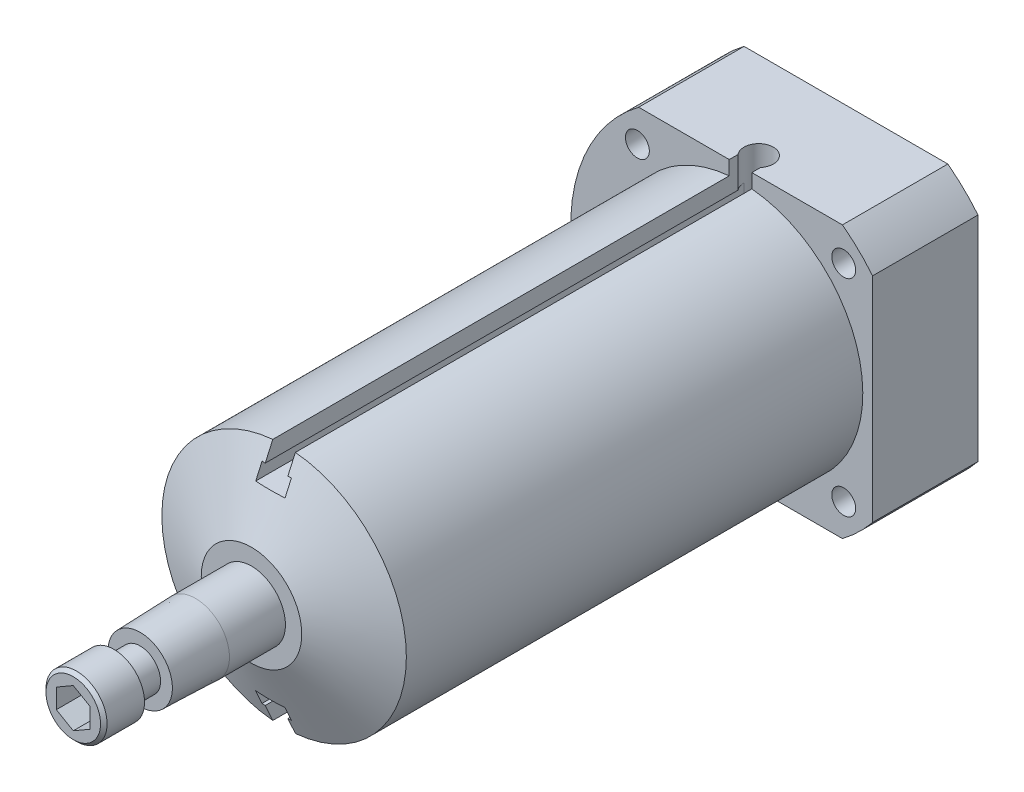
from build123d import *

# Parameters (mm, degrees)
EXTRUDE1_DEPTH     = 138.938
HOLE1_D            = 8.4328
HOLE1_DEPTH        = 19.05
HOLE1_TIP          = 2.533468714
HOLE2_D            = 5.588
CIRPATTERN1_COUNT  = 4
CUT_EXTRUDE1_DEPTH = 118.5418
CUT_EXTRUDE2_DEPTH = 98.425
CUT_EXTRUDE3_REACH = 183.152
SKETCH14_R         = 3.429
CUT_EXTRUDE4_REACH = 183.152
SKETCH15_R         = 3.429
CUT_EXTRUDE5_DEPTH = 6.35


with BuildPart() as part:
    # Sketch1 → Extrude1 (new body)
    with BuildSketch(Plane.XY):
        with BuildLine():
            Line((-23.8125, 31.75), (23.8125, 31.75))
            ThreePointArc((23.8125, 31.75), (27.547135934, 28.570141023), (30.861, 24.953884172))
            Line((30.861, 24.953884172), (30.861, -24.953884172))
            ThreePointArc((30.861, -24.953884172), (27.547135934, -28.570141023), (23.8125, -31.75))
            Line((23.8125, -31.75), (-23.8125, -31.75))
            ThreePointArc((-23.8125, -31.75), (-39.6875, 0), (-23.8125, 31.75))
        make_face()
    extrude(amount=EXTRUDE1_DEPTH)

    # Sketch2 → Cut-Revolve1 (revolve, cut)
    with BuildSketch(Plane(origin=(0, 0, 0), x_dir=(1, 0, 0), z_dir=(0, 1, 0))):
        Polygon((-39.6875, -24.638), (-28.575, -24.638), (-28.575, -131.318), (-11.7475, -138.938), (-39.6875, -138.938), align=None)
    revolve(axis=Axis((0, 0, 0), (0, 0, 1)), mode=Mode.SUBTRACT)

    # Sketch4 → Revolve1 (revolve)
    with BuildSketch(Plane(origin=(0, 0, 0), x_dir=(1, 0, 0), z_dir=(0, 1, 0))):
        Polygon((-7.93115, -138.938), (-7.93115, -152.019), (-7.52475, -164.950857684), (0, -164.950857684), (0, -138.938), align=None)
    revolve(axis=Axis((0, 0, 0), (0, 0, 1)))

    # Hole1
    with Locations(Plane.XY.offset(164.950857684)):
        with Locations((0, 0)):
            Hole(HOLE1_D / 2, depth=HOLE1_DEPTH)
            with Locations((0, 0, -(HOLE1_DEPTH + HOLE1_TIP / 2))):  # 118° drill point
                Cone(0, HOLE1_D / 2, HOLE1_TIP, mode=Mode.SUBTRACT)

    # Hole2 (through all)
    with Locations(Plane.XY.offset(24.638)):
        with Locations((24.111987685, 24.111987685)):
            hole2 = Hole(HOLE2_D / 2)

    # CirPattern1: Hole2 ×4 about axis
    cirpattern1_axis = Axis((0, 0, 0), (0, 0, 1))
    for i in range(1, CIRPATTERN1_COUNT):
        add(hole2.rotate(cirpattern1_axis, i * 360 / CIRPATTERN1_COUNT), mode=Mode.SUBTRACT)

    # Sketch11 → Cut-Revolve2 (revolve, cut)
    with BuildSketch(Plane(origin=(0, 0, 15.7988), x_dir=(-1, 0, 0), z_dir=(0, 0, -1))):
        Polygon((69.889969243, 37.186458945), (23.849533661, 15.717451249), (25.609992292, 11.942135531), (71.650427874, 33.411143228), align=None)
    cut_revolve2 = revolve(axis=Axis((0, 0, 15.7988), (-0.9063077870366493, 0.4226182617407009, 0)), mode=Mode.SUBTRACT)

    # Mirror1: Cut-Revolve2 across plane
    add(cut_revolve2.mirror(Plane.ZX), mode=Mode.SUBTRACT)

    # Sketch12 → Cut-Extrude1 (cut)
    with BuildSketch(Plane.XY.offset(138.938)):
        Polygon((-2.6416, 50.8), (-2.6416, 24.5237), (-3.429, 24.5237), (-3.429, 21.2217), (3.429, 21.2217), (3.429, 24.5237), (2.6416, 24.5237), (2.6416, 50.8), align=None)
    extrude(amount=-CUT_EXTRUDE1_DEPTH, mode=Mode.SUBTRACT)

    # Sketch13 → Cut-Extrude2 (cut)
    with BuildSketch(Plane.XY.offset(138.938)):
        Polygon((-3.429, -21.2217), (3.429, -21.2217), (3.429, -24.5237), (2.6416, -24.5237), (2.6416, -50.8), (-2.6416, -50.8), (-2.6416, -24.5237), (-3.429, -24.5237), align=None)
    extrude(amount=-CUT_EXTRUDE2_DEPTH, mode=Mode.SUBTRACT)

    # Cut-Extrude3: up to this face of the body (flat: up to its plane)
    cut_extrude3_end = Plane(part.part.faces().sort_by_distance((0, 21.2217, 77.501177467))[0])
    # Sketch14 → Cut-Extrude3 (cut, up to the picked face)
    with BuildSketch(Plane(origin=(0, 31.75, 0), x_dir=(1, 0, 0), z_dir=(0, 1, 0)), mode=Mode.PRIVATE) as cut_extrude3_sk1:
        with Locations((0, -20.3962)):
            Circle(SKETCH14_R)
    cut_extrude3_tool1 = split(extrude(cut_extrude3_sk1.sketch, amount=-CUT_EXTRUDE3_REACH, mode=Mode.PRIVATE), bisect_by=cut_extrude3_end, keep=Keep.BOTH, mode=Mode.PRIVATE)
    add(cut_extrude3_tool1.solids().sort_by(Axis((0, 31.75, 20.3962), (0, -1, 0)))[0], mode=Mode.SUBTRACT)

    # Cut-Extrude4: up to this face of the body (flat: up to its plane)
    cut_extrude4_end = Plane(part.part.faces().sort_by_distance((0, -21.2217, 87.559578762))[0])
    # Sketch15 → Cut-Extrude4 (cut, up to the picked face)
    with BuildSketch(Plane.XZ.offset(31.75), mode=Mode.PRIVATE) as cut_extrude4_sk1:
        with Locations((0, 40.513)):
            Circle(SKETCH15_R)
    cut_extrude4_tool1 = split(extrude(cut_extrude4_sk1.sketch, amount=-CUT_EXTRUDE4_REACH, mode=Mode.PRIVATE), bisect_by=cut_extrude4_end, keep=Keep.BOTH, mode=Mode.PRIVATE)
    add(cut_extrude4_tool1.solids().sort_by(Axis((0, -31.75, 40.513), (0, 1, 0)))[0], mode=Mode.SUBTRACT)

    # Sketch16 → Revolve2 (revolve)
    with BuildSketch(Plane(origin=(0, 0, 0), x_dir=(1, 0, 0), z_dir=(0, 1, 0))):
        Polygon((-4.7625, -164.950857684), (-4.7625, -171.069), (-7.1374, -171.069), (-7.1374, -179.832), (-6.3754, -180.594), (0, -180.594), (0, -164.950857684), align=None)
    revolve(axis=Axis((0, 0, 0), (0, 0, 1)))

    # Sketch17 → Cut-Extrude5 (cut)
    with BuildSketch(Plane.XY.offset(180.594)):
        Polygon((3.9624, -2.287692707), (3.9624, 2.287692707), (0, 4.575385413), (-3.9624, 2.287692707), (-3.9624, -2.287692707), (0, -4.575385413), align=None)
    extrude(amount=-CUT_EXTRUDE5_DEPTH, mode=Mode.SUBTRACT)


solid = part.part
